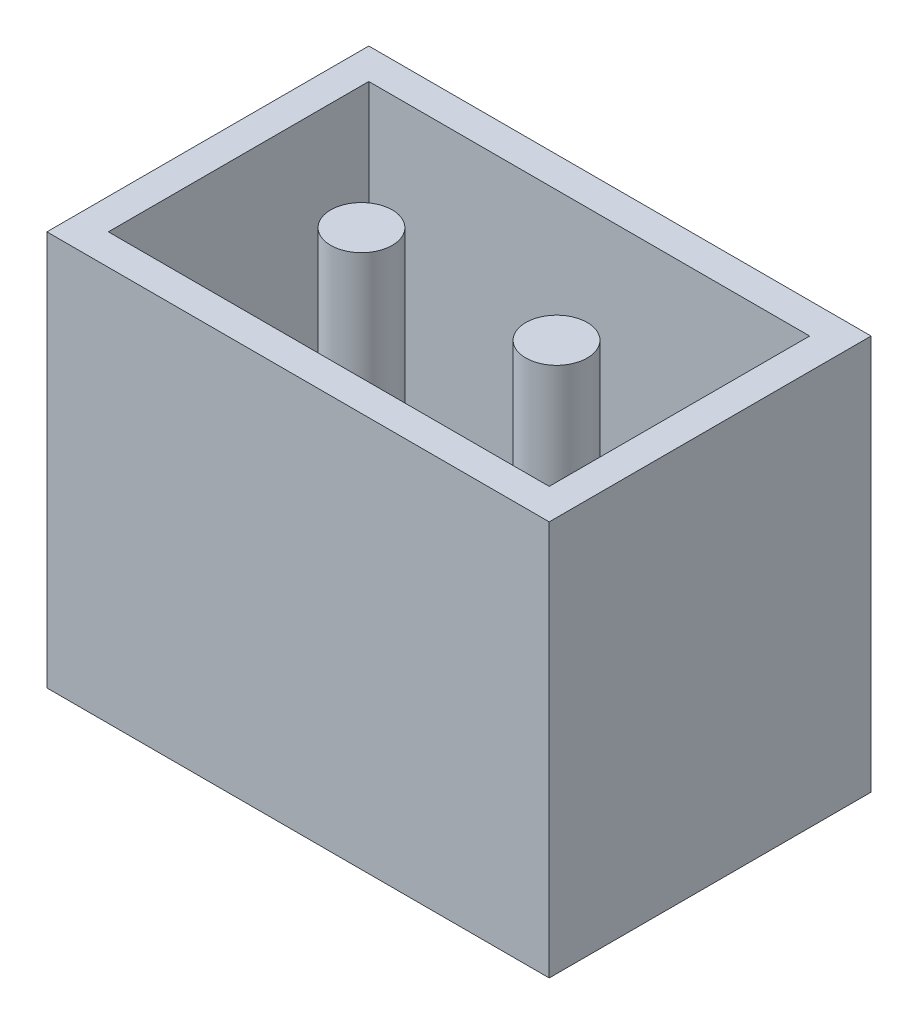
from build123d import *

# Parameters (mm, degrees)
SKETCH1_W          = 13.081
SKETCH1_H          = 8.382
EXTRUDE1_DEPTH     = 10.287
SKETCH2_W          = 11.4808
SKETCH2_H          = 6.7818
SKETCH2_R          = 0.8001
CUT_EXTRUDE1_DEPTH = 7.9375


with BuildPart() as part:
    # Sketch1 → Extrude1 (new body)
    with BuildSketch(Plane(origin=(0, 0, 0), x_dir=(1, 0, 0), z_dir=(0, 1, 0))):
        with Locations((6.5405, 4.191)):
            Rectangle(SKETCH1_W, SKETCH1_H)
    extrude(amount=EXTRUDE1_DEPTH)

    # Sketch2 → Cut-Extrude1 (cut)
    with BuildSketch(Plane(origin=(0, 10.287, 0), x_dir=(-1, 0, 0), z_dir=(0, 1, 0))):
        with Locations((-6.5405, -4.191)):
            Rectangle(SKETCH2_W, SKETCH2_H)
        with Locations(Location((-9.0805, -4.191, 0), (0, 0, 90))):
            Circle(SKETCH2_R, mode=Mode.SUBTRACT)
        with Locations(Location((-4.0005, -4.191, 0), (0, 0, 270))):
            Circle(SKETCH2_R, mode=Mode.SUBTRACT)
    extrude(amount=-CUT_EXTRUDE1_DEPTH, mode=Mode.SUBTRACT)


solid = part.part
